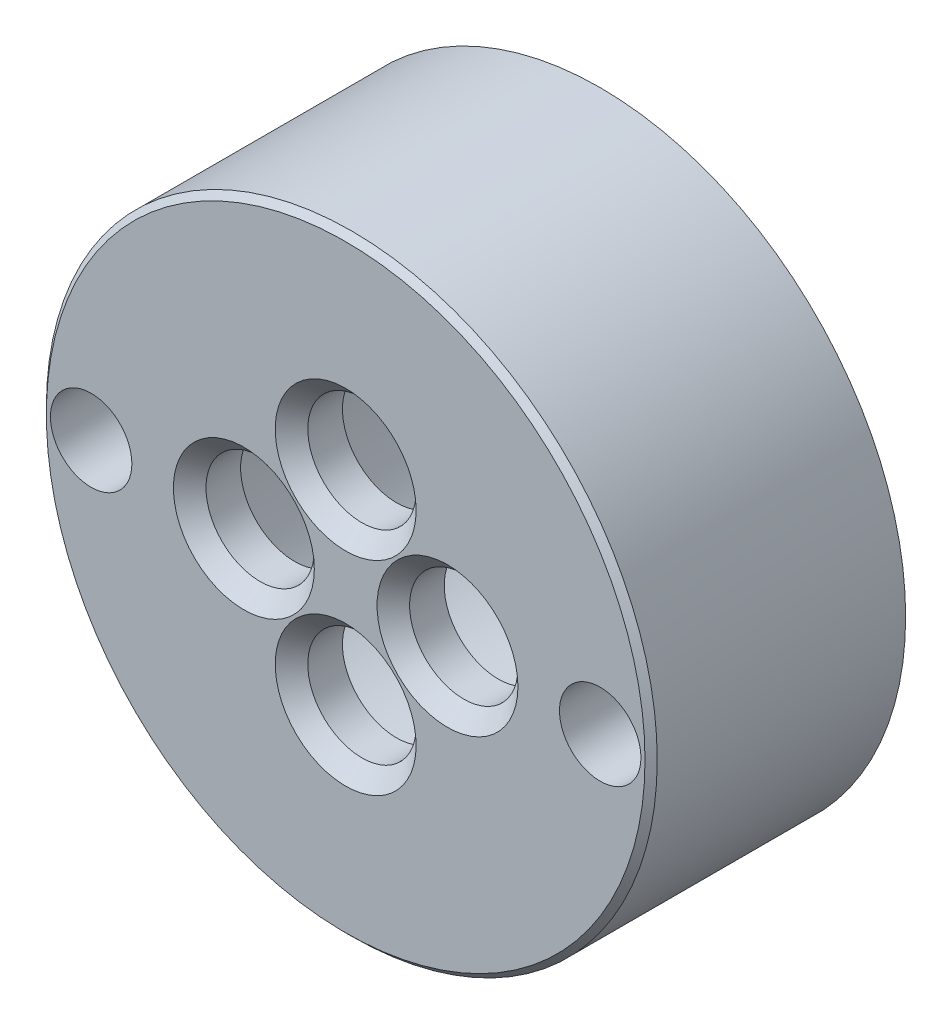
ISO-10303-21;
HEADER;
FILE_DESCRIPTION(('STEP AP214'),'2;1');
FILE_NAME('part.step','',(''),(''),'','','');
FILE_SCHEMA(('AUTOMOTIVE_DESIGN { 1 0 10303 214 1 1 1 1 }'));
ENDSEC;
DATA;
#1=APPLICATION_CONTEXT('core data for automotive mechanical design processes');
#2=APPLICATION_PROTOCOL_DEFINITION('international standard','automotive_design',2000,#1);
#3=PRODUCT_CONTEXT('',#1,'mechanical');
#4=PRODUCT('Part','Part','',(#3));
#5=PRODUCT_RELATED_PRODUCT_CATEGORY('part','',(#4));
#6=PRODUCT_DEFINITION_FORMATION('','',#4);
#7=PRODUCT_DEFINITION_CONTEXT('part definition',#1,'design');
#8=PRODUCT_DEFINITION('design','',#6,#7);
#9=PRODUCT_DEFINITION_SHAPE('','',#8);
#10=(LENGTH_UNIT() NAMED_UNIT(*) SI_UNIT(.MILLI.,.METRE.));
#11=(NAMED_UNIT(*) PLANE_ANGLE_UNIT() SI_UNIT($,.RADIAN.));
#12=(NAMED_UNIT(*) SI_UNIT($,.STERADIAN.) SOLID_ANGLE_UNIT());
#13=UNCERTAINTY_MEASURE_WITH_UNIT(LENGTH_MEASURE(1.E-05),#10,'distance_accuracy_value','');
#14=(GEOMETRIC_REPRESENTATION_CONTEXT(3) GLOBAL_UNCERTAINTY_ASSIGNED_CONTEXT((#13)) GLOBAL_UNIT_ASSIGNED_CONTEXT((#10,
#11,#12)) REPRESENTATION_CONTEXT('',''));
#15=CARTESIAN_POINT('',(0.,0.,0.));
#16=DIRECTION('',(0.,0.,1.));
#17=DIRECTION('',(1.,0.,0.));
#18=AXIS2_PLACEMENT_3D('',#15,#16,#17);
#19=CARTESIAN_POINT('',(-101.092,-101.6,0.));
#20=DIRECTION('',(0.,0.,1.));
#21=DIRECTION('',(1.,0.,0.));
#22=AXIS2_PLACEMENT_3D('',#19,#20,#21);
#23=PLANE('',#22);
#24=CARTESIAN_POINT('',(-85.217,-101.6,0.));
#25=DIRECTION('',(0.,0.,1.));
#26=DIRECTION('',(1.,0.,0.));
#27=AXIS2_PLACEMENT_3D('',#24,#25,#26);
#28=CIRCLE('',#27,2.53999999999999);
#29=CARTESIAN_POINT('',(-82.677,-101.6,0.));
#30=VERTEX_POINT('',#29);
#31=EDGE_CURVE('E88',#30,#30,#28,.T.);
#32=ORIENTED_EDGE('',*,*,#31,.T.);
#33=EDGE_LOOP('',(#32));
#34=FACE_BOUND('',#33,.T.);
#35=CARTESIAN_POINT('',(-116.967,-101.6,0.));
#36=DIRECTION('',(0.,0.,1.));
#37=DIRECTION('',(1.,0.,0.));
#38=AXIS2_PLACEMENT_3D('',#35,#36,#37);
#39=CIRCLE('',#38,2.53999999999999);
#40=CARTESIAN_POINT('',(-114.427,-101.6,0.));
#41=VERTEX_POINT('',#40);
#42=EDGE_CURVE('E84',#41,#41,#39,.T.);
#43=ORIENTED_EDGE('',*,*,#42,.T.);
#44=EDGE_LOOP('',(#43));
#45=FACE_BOUND('',#44,.T.);
#46=CARTESIAN_POINT('',(-101.092,-101.6,0.));
#47=DIRECTION('',(0.,0.,1.));
#48=DIRECTION('',(1.,0.,0.));
#49=AXIS2_PLACEMENT_3D('',#46,#47,#48);
#50=CIRCLE('',#49,19.05);
#51=CARTESIAN_POINT('',(-82.042,-101.6,0.));
#52=VERTEX_POINT('',#51);
#53=EDGE_CURVE('E75',#52,#52,#50,.T.);
#54=ORIENTED_EDGE('',*,*,#53,.F.);
#55=EDGE_LOOP('',(#54));
#56=FACE_BOUND('',#55,.T.);
#57=CARTESIAN_POINT('',(-101.092,-101.6,0.));
#58=DIRECTION('',(0.,0.,1.));
#59=DIRECTION('',(1.,0.,0.));
#60=AXIS2_PLACEMENT_3D('',#57,#58,#59);
#61=CIRCLE('',#60,11.1125);
#62=CARTESIAN_POINT('',(-89.9795,-101.6,0.));
#63=VERTEX_POINT('',#62);
#64=EDGE_CURVE('E78',#63,#63,#61,.T.);
#65=ORIENTED_EDGE('',*,*,#64,.T.);
#66=EDGE_LOOP('',(#65));
#67=FACE_BOUND('',#66,.T.);
#68=ADVANCED_FACE('F37',(#34,#45,#56,#67),#23,.F.);
#69=CARTESIAN_POINT('',(-101.092,-101.6,12.7));
#70=DIRECTION('',(0.,0.,-1.));
#71=DIRECTION('',(-1.,0.,0.));
#72=AXIS2_PLACEMENT_3D('',#69,#70,#71);
#73=CYLINDRICAL_SURFACE('',#72,19.05);
#74=CARTESIAN_POINT('',(-101.092,-101.6,15.494));
#75=DIRECTION('',(0.,0.,1.));
#76=DIRECTION('',(1.,0.,0.));
#77=AXIS2_PLACEMENT_3D('',#74,#75,#76);
#78=CIRCLE('',#77,19.05);
#79=CARTESIAN_POINT('',(-82.042,-101.6,15.494));
#80=VERTEX_POINT('',#79);
#81=EDGE_CURVE('E69',#80,#80,#78,.F.);
#82=ORIENTED_EDGE('',*,*,#81,.T.);
#83=EDGE_LOOP('',(#82));
#84=FACE_BOUND('',#83,.T.);
#85=ORIENTED_EDGE('',*,*,#53,.T.);
#86=EDGE_LOOP('',(#85));
#87=FACE_BOUND('',#86,.T.);
#88=ADVANCED_FACE('F128',(#84,#87),#73,.T.);
#89=CARTESIAN_POINT('',(-101.092,-101.6,12.7));
#90=DIRECTION('',(0.,0.,-1.));
#91=DIRECTION('',(-1.,0.,0.));
#92=AXIS2_PLACEMENT_3D('',#89,#90,#91);
#93=CYLINDRICAL_SURFACE('',#92,11.1125);
#94=CARTESIAN_POINT('',(-101.092,-101.6,12.7));
#95=DIRECTION('',(0.,0.,1.));
#96=DIRECTION('',(1.,0.,0.));
#97=AXIS2_PLACEMENT_3D('',#94,#95,#96);
#98=CIRCLE('',#97,11.1125);
#99=CARTESIAN_POINT('',(-89.9795,-101.6,12.7));
#100=VERTEX_POINT('',#99);
#101=EDGE_CURVE('E81',#100,#100,#98,.T.);
#102=ORIENTED_EDGE('',*,*,#101,.T.);
#103=EDGE_LOOP('',(#102));
#104=FACE_BOUND('',#103,.T.);
#105=ORIENTED_EDGE('',*,*,#64,.F.);
#106=EDGE_LOOP('',(#105));
#107=FACE_BOUND('',#106,.T.);
#108=ADVANCED_FACE('F134',(#104,#107),#93,.F.);
#109=CARTESIAN_POINT('',(-101.092,-101.6,12.7));
#110=DIRECTION('',(0.,0.,1.));
#111=DIRECTION('',(1.,0.,0.));
#112=AXIS2_PLACEMENT_3D('',#109,#110,#111);
#113=PLANE('',#112);
#114=CARTESIAN_POINT('',(-101.092,-95.25,12.7));
#115=DIRECTION('',(0.,0.,1.));
#116=DIRECTION('',(1.,0.,0.));
#117=AXIS2_PLACEMENT_3D('',#114,#115,#116);
#118=CIRCLE('',#117,3.37819999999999);
#119=CARTESIAN_POINT('',(-97.7138,-95.25,12.7));
#120=VERTEX_POINT('',#119);
#121=EDGE_CURVE('E105',#120,#120,#118,.T.);
#122=ORIENTED_EDGE('',*,*,#121,.T.);
#123=EDGE_LOOP('',(#122));
#124=FACE_BOUND('',#123,.T.);
#125=CARTESIAN_POINT('',(-107.442,-101.6,12.7));
#126=DIRECTION('',(0.,0.,1.));
#127=DIRECTION('',(1.,0.,0.));
#128=AXIS2_PLACEMENT_3D('',#125,#126,#127);
#129=CIRCLE('',#128,3.37819999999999);
#130=CARTESIAN_POINT('',(-104.0638,-101.6,12.7));
#131=VERTEX_POINT('',#130);
#132=EDGE_CURVE('E102',#131,#131,#129,.T.);
#133=ORIENTED_EDGE('',*,*,#132,.T.);
#134=EDGE_LOOP('',(#133));
#135=FACE_BOUND('',#134,.T.);
#136=CARTESIAN_POINT('',(-101.092,-107.95,12.7));
#137=DIRECTION('',(0.,0.,1.));
#138=DIRECTION('',(1.,0.,0.));
#139=AXIS2_PLACEMENT_3D('',#136,#137,#138);
#140=CIRCLE('',#139,3.37819999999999);
#141=CARTESIAN_POINT('',(-97.7138,-107.95,12.7));
#142=VERTEX_POINT('',#141);
#143=EDGE_CURVE('E99',#142,#142,#140,.T.);
#144=ORIENTED_EDGE('',*,*,#143,.T.);
#145=EDGE_LOOP('',(#144));
#146=FACE_BOUND('',#145,.T.);
#147=CARTESIAN_POINT('',(-94.742,-101.6,12.7));
#148=DIRECTION('',(0.,0.,1.));
#149=DIRECTION('',(1.,0.,0.));
#150=AXIS2_PLACEMENT_3D('',#147,#148,#149);
#151=CIRCLE('',#150,3.37819999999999);
#152=CARTESIAN_POINT('',(-91.3638,-101.6,12.7));
#153=VERTEX_POINT('',#152);
#154=EDGE_CURVE('E94',#153,#153,#151,.T.);
#155=ORIENTED_EDGE('',*,*,#154,.T.);
#156=EDGE_LOOP('',(#155));
#157=FACE_BOUND('',#156,.T.);
#158=ORIENTED_EDGE('',*,*,#101,.F.);
#159=EDGE_LOOP('',(#158));
#160=FACE_BOUND('',#159,.T.);
#161=ADVANCED_FACE('F109',(#124,#135,#146,#157,#160),#113,.F.);
#162=CARTESIAN_POINT('',(-101.092,-101.6,15.875));
#163=DIRECTION('',(0.,0.,1.));
#164=DIRECTION('',(1.,0.,0.));
#165=AXIS2_PLACEMENT_3D('',#162,#163,#164);
#166=PLANE('',#165);
#167=CARTESIAN_POINT('',(-107.442,-101.6,15.875));
#168=DIRECTION('',(0.,0.,1.));
#169=DIRECTION('',(1.,0.,0.));
#170=AXIS2_PLACEMENT_3D('',#167,#168,#169);
#171=CIRCLE('',#170,4.39419999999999);
#172=CARTESIAN_POINT('',(-103.0478,-101.6,15.875));
#173=VERTEX_POINT('',#172);
#174=EDGE_CURVE('E52',#173,#173,#171,.F.);
#175=ORIENTED_EDGE('',*,*,#174,.T.);
#176=EDGE_LOOP('',(#175));
#177=FACE_BOUND('',#176,.T.);
#178=CARTESIAN_POINT('',(-101.092,-107.95,15.875));
#179=DIRECTION('',(0.,0.,1.));
#180=DIRECTION('',(1.,0.,0.));
#181=AXIS2_PLACEMENT_3D('',#178,#179,#180);
#182=CIRCLE('',#181,4.39419999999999);
#183=CARTESIAN_POINT('',(-96.6978,-107.95,15.875));
#184=VERTEX_POINT('',#183);
#185=EDGE_CURVE('E57',#184,#184,#182,.F.);
#186=ORIENTED_EDGE('',*,*,#185,.T.);
#187=EDGE_LOOP('',(#186));
#188=FACE_BOUND('',#187,.T.);
#189=CARTESIAN_POINT('',(-101.092,-95.25,15.875));
#190=DIRECTION('',(0.,0.,1.));
#191=DIRECTION('',(1.,0.,0.));
#192=AXIS2_PLACEMENT_3D('',#189,#190,#191);
#193=CIRCLE('',#192,4.39419999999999);
#194=CARTESIAN_POINT('',(-96.6978,-95.25,15.875));
#195=VERTEX_POINT('',#194);
#196=EDGE_CURVE('E60',#195,#195,#193,.F.);
#197=ORIENTED_EDGE('',*,*,#196,.T.);
#198=EDGE_LOOP('',(#197));
#199=FACE_BOUND('',#198,.T.);
#200=CARTESIAN_POINT('',(-94.742,-101.6,15.875));
#201=DIRECTION('',(0.,0.,1.));
#202=DIRECTION('',(1.,0.,0.));
#203=AXIS2_PLACEMENT_3D('',#200,#201,#202);
#204=CIRCLE('',#203,4.39419999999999);
#205=CARTESIAN_POINT('',(-90.3478,-101.6,15.875));
#206=VERTEX_POINT('',#205);
#207=EDGE_CURVE('E63',#206,#206,#204,.F.);
#208=ORIENTED_EDGE('',*,*,#207,.T.);
#209=EDGE_LOOP('',(#208));
#210=FACE_BOUND('',#209,.T.);
#211=CARTESIAN_POINT('',(-101.092,-101.6,15.875));
#212=DIRECTION('',(0.,0.,1.));
#213=DIRECTION('',(1.,0.,0.));
#214=AXIS2_PLACEMENT_3D('',#211,#212,#213);
#215=CIRCLE('',#214,18.669);
#216=CARTESIAN_POINT('',(-82.423,-101.6,15.875));
#217=VERTEX_POINT('',#216);
#218=EDGE_CURVE('E72',#217,#217,#215,.T.);
#219=ORIENTED_EDGE('',*,*,#218,.T.);
#220=EDGE_LOOP('',(#219));
#221=FACE_BOUND('',#220,.T.);
#222=CARTESIAN_POINT('',(-85.217,-101.6,15.875));
#223=DIRECTION('',(0.,0.,1.));
#224=DIRECTION('',(1.,0.,0.));
#225=AXIS2_PLACEMENT_3D('',#222,#223,#224);
#226=CIRCLE('',#225,2.53999999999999);
#227=CARTESIAN_POINT('',(-82.677,-101.6,15.875));
#228=VERTEX_POINT('',#227);
#229=EDGE_CURVE('E91',#228,#228,#226,.T.);
#230=ORIENTED_EDGE('',*,*,#229,.F.);
#231=EDGE_LOOP('',(#230));
#232=FACE_BOUND('',#231,.T.);
#233=CARTESIAN_POINT('',(-116.967,-101.6,15.875));
#234=DIRECTION('',(0.,0.,1.));
#235=DIRECTION('',(1.,0.,0.));
#236=AXIS2_PLACEMENT_3D('',#233,#234,#235);
#237=CIRCLE('',#236,2.53999999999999);
#238=CARTESIAN_POINT('',(-114.427,-101.6,15.875));
#239=VERTEX_POINT('',#238);
#240=EDGE_CURVE('E85',#239,#239,#237,.T.);
#241=ORIENTED_EDGE('',*,*,#240,.F.);
#242=EDGE_LOOP('',(#241));
#243=FACE_BOUND('',#242,.T.);
#244=ADVANCED_FACE('F157',(#177,#188,#199,#210,#221,#232,#243),#166,.T.);
#245=CARTESIAN_POINT('',(-116.967,-101.6,0.));
#246=DIRECTION('',(0.,0.,1.));
#247=DIRECTION('',(1.,0.,0.));
#248=AXIS2_PLACEMENT_3D('',#245,#246,#247);
#249=CYLINDRICAL_SURFACE('',#248,2.53999999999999);
#250=ORIENTED_EDGE('',*,*,#42,.F.);
#251=EDGE_LOOP('',(#250));
#252=FACE_BOUND('',#251,.T.);
#253=ORIENTED_EDGE('',*,*,#240,.T.);
#254=EDGE_LOOP('',(#253));
#255=FACE_BOUND('',#254,.T.);
#256=ADVANCED_FACE('F160',(#252,#255),#249,.F.);
#257=CARTESIAN_POINT('',(-85.217,-101.6,0.));
#258=DIRECTION('',(0.,0.,1.));
#259=DIRECTION('',(1.,0.,0.));
#260=AXIS2_PLACEMENT_3D('',#257,#258,#259);
#261=CYLINDRICAL_SURFACE('',#260,2.53999999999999);
#262=ORIENTED_EDGE('',*,*,#31,.F.);
#263=EDGE_LOOP('',(#262));
#264=FACE_BOUND('',#263,.T.);
#265=ORIENTED_EDGE('',*,*,#229,.T.);
#266=EDGE_LOOP('',(#265));
#267=FACE_BOUND('',#266,.T.);
#268=ADVANCED_FACE('F172',(#264,#267),#261,.F.);
#269=CARTESIAN_POINT('',(-94.742,-101.6,0.));
#270=DIRECTION('',(0.,0.,1.));
#271=DIRECTION('',(1.,0.,0.));
#272=AXIS2_PLACEMENT_3D('',#269,#270,#271);
#273=CYLINDRICAL_SURFACE('',#272,3.37819999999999);
#274=CARTESIAN_POINT('',(-94.742,-101.6,14.859));
#275=DIRECTION('',(0.,0.,1.));
#276=DIRECTION('',(1.,0.,0.));
#277=AXIS2_PLACEMENT_3D('',#274,#275,#276);
#278=CIRCLE('',#277,3.37819999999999);
#279=CARTESIAN_POINT('',(-91.3638,-101.6,14.859));
#280=VERTEX_POINT('',#279);
#281=EDGE_CURVE('E10',#280,#280,#278,.T.);
#282=ORIENTED_EDGE('',*,*,#281,.T.);
#283=EDGE_LOOP('',(#282));
#284=FACE_BOUND('',#283,.T.);
#285=ORIENTED_EDGE('',*,*,#154,.F.);
#286=EDGE_LOOP('',(#285));
#287=FACE_BOUND('',#286,.T.);
#288=ADVANCED_FACE('F178',(#284,#287),#273,.F.);
#289=CARTESIAN_POINT('',(-101.092,-107.95,0.));
#290=DIRECTION('',(0.,0.,1.));
#291=DIRECTION('',(1.,0.,0.));
#292=AXIS2_PLACEMENT_3D('',#289,#290,#291);
#293=CYLINDRICAL_SURFACE('',#292,3.37819999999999);
#294=CARTESIAN_POINT('',(-101.092,-107.95,14.859));
#295=DIRECTION('',(0.,0.,1.));
#296=DIRECTION('',(1.,0.,0.));
#297=AXIS2_PLACEMENT_3D('',#294,#295,#296);
#298=CIRCLE('',#297,3.37819999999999);
#299=CARTESIAN_POINT('',(-97.7138,-107.95,14.859));
#300=VERTEX_POINT('',#299);
#301=EDGE_CURVE('E48',#300,#300,#298,.T.);
#302=ORIENTED_EDGE('',*,*,#301,.T.);
#303=EDGE_LOOP('',(#302));
#304=FACE_BOUND('',#303,.T.);
#305=ORIENTED_EDGE('',*,*,#143,.F.);
#306=EDGE_LOOP('',(#305));
#307=FACE_BOUND('',#306,.T.);
#308=ADVANCED_FACE('F124',(#304,#307),#293,.F.);
#309=CARTESIAN_POINT('',(-107.442,-101.6,0.));
#310=DIRECTION('',(0.,0.,1.));
#311=DIRECTION('',(1.,0.,0.));
#312=AXIS2_PLACEMENT_3D('',#309,#310,#311);
#313=CYLINDRICAL_SURFACE('',#312,3.37819999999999);
#314=CARTESIAN_POINT('',(-107.442,-101.6,14.859));
#315=DIRECTION('',(0.,0.,1.));
#316=DIRECTION('',(1.,0.,0.));
#317=AXIS2_PLACEMENT_3D('',#314,#315,#316);
#318=CIRCLE('',#317,3.37819999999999);
#319=CARTESIAN_POINT('',(-104.0638,-101.6,14.859));
#320=VERTEX_POINT('',#319);
#321=EDGE_CURVE('E66',#320,#320,#318,.T.);
#322=ORIENTED_EDGE('',*,*,#321,.T.);
#323=EDGE_LOOP('',(#322));
#324=FACE_BOUND('',#323,.T.);
#325=ORIENTED_EDGE('',*,*,#132,.F.);
#326=EDGE_LOOP('',(#325));
#327=FACE_BOUND('',#326,.T.);
#328=ADVANCED_FACE('F115',(#324,#327),#313,.F.);
#329=CARTESIAN_POINT('',(-101.092,-95.25,0.));
#330=DIRECTION('',(0.,0.,1.));
#331=DIRECTION('',(1.,0.,0.));
#332=AXIS2_PLACEMENT_3D('',#329,#330,#331);
#333=CYLINDRICAL_SURFACE('',#332,3.37819999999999);
#334=CARTESIAN_POINT('',(-101.092,-95.25,14.859));
#335=DIRECTION('',(0.,0.,1.));
#336=DIRECTION('',(1.,0.,0.));
#337=AXIS2_PLACEMENT_3D('',#334,#335,#336);
#338=CIRCLE('',#337,3.37819999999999);
#339=CARTESIAN_POINT('',(-97.7138,-95.25,14.859));
#340=VERTEX_POINT('',#339);
#341=EDGE_CURVE('E44',#340,#340,#338,.T.);
#342=ORIENTED_EDGE('',*,*,#341,.T.);
#343=EDGE_LOOP('',(#342));
#344=FACE_BOUND('',#343,.T.);
#345=ORIENTED_EDGE('',*,*,#121,.F.);
#346=EDGE_LOOP('',(#345));
#347=FACE_BOUND('',#346,.T.);
#348=ADVANCED_FACE('F112',(#344,#347),#333,.F.);
#349=CARTESIAN_POINT('',(-101.092,-101.6,15.875));
#350=DIRECTION('',(0.,0.,-1.));
#351=DIRECTION('',(-1.,0.,0.));
#352=AXIS2_PLACEMENT_3D('',#349,#350,#351);
#353=CONICAL_SURFACE('',#352,18.669,0.785398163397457);
#354=ORIENTED_EDGE('',*,*,#81,.F.);
#355=EDGE_LOOP('',(#354));
#356=FACE_BOUND('',#355,.T.);
#357=ORIENTED_EDGE('',*,*,#218,.F.);
#358=EDGE_LOOP('',(#357));
#359=FACE_BOUND('',#358,.T.);
#360=ADVANCED_FACE('F114',(#356,#359),#353,.T.);
#361=CARTESIAN_POINT('',(-107.442,-101.6,14.859));
#362=DIRECTION('',(0.,0.,1.));
#363=DIRECTION('',(1.,0.,0.));
#364=AXIS2_PLACEMENT_3D('',#361,#362,#363);
#365=CONICAL_SURFACE('',#364,3.37819999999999,0.785398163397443);
#366=ORIENTED_EDGE('',*,*,#174,.F.);
#367=EDGE_LOOP('',(#366));
#368=FACE_BOUND('',#367,.T.);
#369=ORIENTED_EDGE('',*,*,#321,.F.);
#370=EDGE_LOOP('',(#369));
#371=FACE_BOUND('',#370,.T.);
#372=ADVANCED_FACE('F121',(#368,#371),#365,.F.);
#373=CARTESIAN_POINT('',(-101.092,-107.95,14.859));
#374=DIRECTION('',(0.,0.,1.));
#375=DIRECTION('',(1.,0.,0.));
#376=AXIS2_PLACEMENT_3D('',#373,#374,#375);
#377=CONICAL_SURFACE('',#376,3.37819999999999,0.785398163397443);
#378=ORIENTED_EDGE('',*,*,#185,.F.);
#379=EDGE_LOOP('',(#378));
#380=FACE_BOUND('',#379,.T.);
#381=ORIENTED_EDGE('',*,*,#301,.F.);
#382=EDGE_LOOP('',(#381));
#383=FACE_BOUND('',#382,.T.);
#384=ADVANCED_FACE('F143',(#380,#383),#377,.F.);
#385=CARTESIAN_POINT('',(-101.092,-95.25,14.859));
#386=DIRECTION('',(0.,0.,1.));
#387=DIRECTION('',(1.,0.,0.));
#388=AXIS2_PLACEMENT_3D('',#385,#386,#387);
#389=CONICAL_SURFACE('',#388,3.37819999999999,0.785398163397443);
#390=ORIENTED_EDGE('',*,*,#196,.F.);
#391=EDGE_LOOP('',(#390));
#392=FACE_BOUND('',#391,.T.);
#393=ORIENTED_EDGE('',*,*,#341,.F.);
#394=EDGE_LOOP('',(#393));
#395=FACE_BOUND('',#394,.T.);
#396=ADVANCED_FACE('F146',(#392,#395),#389,.F.);
#397=CARTESIAN_POINT('',(-94.742,-101.6,14.859));
#398=DIRECTION('',(0.,0.,1.));
#399=DIRECTION('',(1.,0.,0.));
#400=AXIS2_PLACEMENT_3D('',#397,#398,#399);
#401=CONICAL_SURFACE('',#400,3.37819999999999,0.785398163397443);
#402=ORIENTED_EDGE('',*,*,#207,.F.);
#403=EDGE_LOOP('',(#402));
#404=FACE_BOUND('',#403,.T.);
#405=ORIENTED_EDGE('',*,*,#281,.F.);
#406=EDGE_LOOP('',(#405));
#407=FACE_BOUND('',#406,.T.);
#408=ADVANCED_FACE('F39',(#404,#407),#401,.F.);
#409=CLOSED_SHELL('',(#68,#88,#108,#161,#244,#256,#268,#288,#308,#328,#348,#360,#372,#384,#396,#408));
#410=MANIFOLD_SOLID_BREP('B2',#409);
#411=ADVANCED_BREP_SHAPE_REPRESENTATION('',(#18,#410),#14);
#412=SHAPE_DEFINITION_REPRESENTATION(#9,#411);
ENDSEC;
END-ISO-10303-21;
